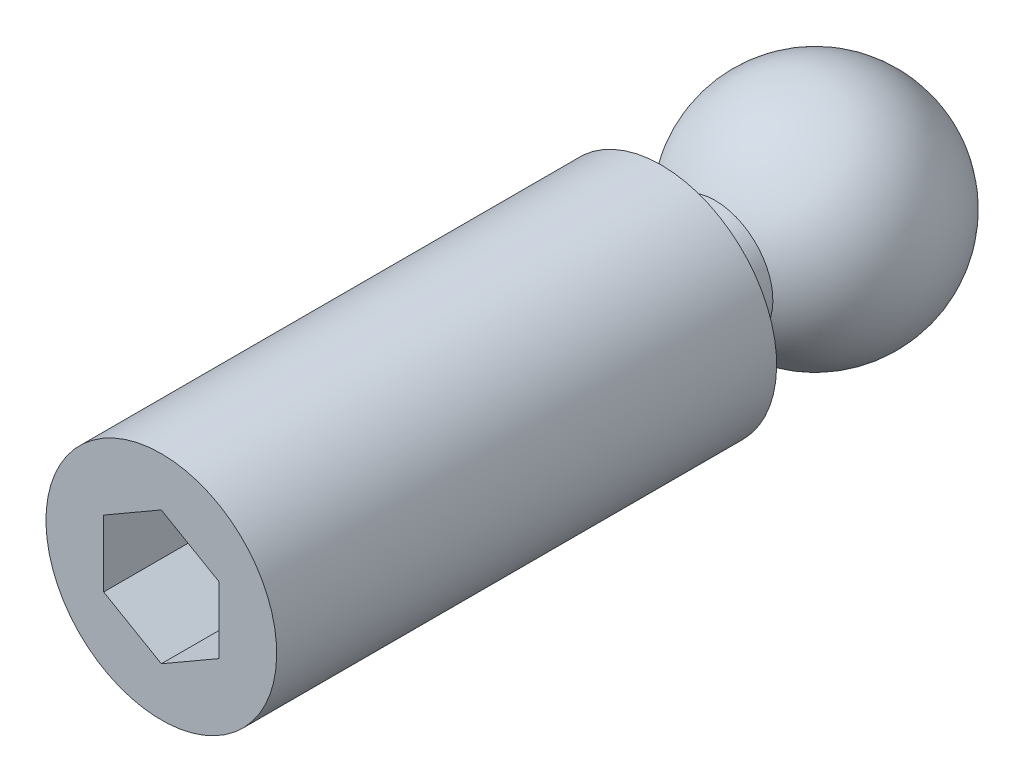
ISO-10303-21;
HEADER;
FILE_DESCRIPTION(('STEP AP214'),'2;1');
FILE_NAME('part.step','',(''),(''),'','','');
FILE_SCHEMA(('AUTOMOTIVE_DESIGN { 1 0 10303 214 1 1 1 1 }'));
ENDSEC;
DATA;
#1=APPLICATION_CONTEXT('core data for automotive mechanical design processes');
#2=APPLICATION_PROTOCOL_DEFINITION('international standard','automotive_design',2000,#1);
#3=PRODUCT_CONTEXT('',#1,'mechanical');
#4=PRODUCT('Part','Part','',(#3));
#5=PRODUCT_RELATED_PRODUCT_CATEGORY('part','',(#4));
#6=PRODUCT_DEFINITION_FORMATION('','',#4);
#7=PRODUCT_DEFINITION_CONTEXT('part definition',#1,'design');
#8=PRODUCT_DEFINITION('design','',#6,#7);
#9=PRODUCT_DEFINITION_SHAPE('','',#8);
#10=(LENGTH_UNIT() NAMED_UNIT(*) SI_UNIT(.MILLI.,.METRE.));
#11=(NAMED_UNIT(*) PLANE_ANGLE_UNIT() SI_UNIT($,.RADIAN.));
#12=(NAMED_UNIT(*) SI_UNIT($,.STERADIAN.) SOLID_ANGLE_UNIT());
#13=UNCERTAINTY_MEASURE_WITH_UNIT(LENGTH_MEASURE(1.E-05),#10,'distance_accuracy_value','');
#14=(GEOMETRIC_REPRESENTATION_CONTEXT(3) GLOBAL_UNCERTAINTY_ASSIGNED_CONTEXT((#13)) GLOBAL_UNIT_ASSIGNED_CONTEXT((#10,
#11,#12)) REPRESENTATION_CONTEXT('',''));
#15=CARTESIAN_POINT('',(0.,0.,0.));
#16=DIRECTION('',(0.,0.,1.));
#17=DIRECTION('',(1.,0.,0.));
#18=AXIS2_PLACEMENT_3D('',#15,#16,#17);
#19=CARTESIAN_POINT('',(0.,0.,3.));
#20=DIRECTION('',(0.,-1.,0.));
#21=DIRECTION('',(-1.,0.,0.));
#22=AXIS2_PLACEMENT_3D('',#19,#20,#21);
#23=SPHERICAL_SURFACE('',#22,3.);
#24=CARTESIAN_POINT('',(0.,0.,3.));
#25=DIRECTION('',(0.,0.,1.));
#26=DIRECTION('',(0.,1.,0.));
#27=AXIS2_PLACEMENT_3D('',#24,#25,#26);
#28=SPHERICAL_SURFACE('',#27,3.);
#29=CARTESIAN_POINT('',(0.,0.,5.59807621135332));
#30=DIRECTION('',(0.,0.,1.));
#31=DIRECTION('',(0.,1.,0.));
#32=AXIS2_PLACEMENT_3D('',#29,#30,#31);
#33=CIRCLE('',#32,1.5);
#34=CARTESIAN_POINT('',(0.,1.5,5.59807621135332));
#35=VERTEX_POINT('',#34);
#36=EDGE_CURVE('E9',#35,#35,#33,.T.);
#37=ORIENTED_EDGE('',*,*,#36,.F.);
#38=EDGE_LOOP('',(#37));
#39=FACE_BOUND('',#38,.T.);
#40=ADVANCED_FACE('F14',(#39),#28,.T.);
#41=CARTESIAN_POINT('',(0.,0.,30.));
#42=DIRECTION('',(0.,0.,1.));
#43=DIRECTION('',(0.,1.,0.));
#44=AXIS2_PLACEMENT_3D('',#41,#42,#43);
#45=CYLINDRICAL_SURFACE('',#44,1.5);
#46=ORIENTED_EDGE('',*,*,#36,.T.);
#47=EDGE_LOOP('',(#46));
#48=FACE_BOUND('',#47,.T.);
#49=CARTESIAN_POINT('',(0.,0.,7.));
#50=DIRECTION('',(0.,0.,1.));
#51=DIRECTION('',(0.,1.,0.));
#52=AXIS2_PLACEMENT_3D('',#49,#50,#51);
#53=CIRCLE('',#52,1.5);
#54=CARTESIAN_POINT('',(0.,1.5,7.));
#55=VERTEX_POINT('',#54);
#56=EDGE_CURVE('E21',#55,#55,#53,.T.);
#57=ORIENTED_EDGE('',*,*,#56,.F.);
#58=EDGE_LOOP('',(#57));
#59=FACE_BOUND('',#58,.T.);
#60=ADVANCED_FACE('F131',(#48,#59),#45,.T.);
#61=CARTESIAN_POINT('',(0.,-3.,7.));
#62=DIRECTION('',(0.,0.,-1.));
#63=DIRECTION('',(0.,-1.,0.));
#64=AXIS2_PLACEMENT_3D('',#61,#62,#63);
#65=PLANE('',#64);
#66=ORIENTED_EDGE('',*,*,#56,.T.);
#67=EDGE_LOOP('',(#66));
#68=FACE_BOUND('',#67,.T.);
#69=CARTESIAN_POINT('',(0.,0.,7.));
#70=DIRECTION('',(0.,0.,1.));
#71=DIRECTION('',(0.,1.,0.));
#72=AXIS2_PLACEMENT_3D('',#69,#70,#71);
#73=CIRCLE('',#72,3.);
#74=CARTESIAN_POINT('',(0.,3.,7.));
#75=VERTEX_POINT('',#74);
#76=EDGE_CURVE('E123',#75,#75,#73,.T.);
#77=ORIENTED_EDGE('',*,*,#76,.F.);
#78=EDGE_LOOP('',(#77));
#79=FACE_BOUND('',#78,.T.);
#80=ADVANCED_FACE('F128',(#68,#79),#65,.T.);
#81=CARTESIAN_POINT('',(0.,0.,30.));
#82=DIRECTION('',(0.,0.,1.));
#83=DIRECTION('',(0.,1.,0.));
#84=AXIS2_PLACEMENT_3D('',#81,#82,#83);
#85=CYLINDRICAL_SURFACE('',#84,3.);
#86=ORIENTED_EDGE('',*,*,#76,.T.);
#87=EDGE_LOOP('',(#86));
#88=FACE_BOUND('',#87,.T.);
#89=CARTESIAN_POINT('',(0.,0.,20.));
#90=DIRECTION('',(0.,0.,1.));
#91=DIRECTION('',(0.,1.,0.));
#92=AXIS2_PLACEMENT_3D('',#89,#90,#91);
#93=CIRCLE('',#92,3.);
#94=CARTESIAN_POINT('',(0.,3.,20.));
#95=VERTEX_POINT('',#94);
#96=EDGE_CURVE('E115',#95,#95,#93,.T.);
#97=ORIENTED_EDGE('',*,*,#96,.F.);
#98=EDGE_LOOP('',(#97));
#99=FACE_BOUND('',#98,.T.);
#100=ADVANCED_FACE('F139',(#88,#99),#85,.T.);
#101=CARTESIAN_POINT('',(0.,0.,20.));
#102=DIRECTION('',(0.,0.,1.));
#103=DIRECTION('',(0.,1.,0.));
#104=AXIS2_PLACEMENT_3D('',#101,#102,#103);
#105=PLANE('',#104);
#106=DIRECTION('',(-0.866025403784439,0.5,0.));
#107=VECTOR('',#106,1.);
#108=CARTESIAN_POINT('',(1.5,0.86602540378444,20.));
#109=LINE('',#108,#107);
#110=CARTESIAN_POINT('',(1.5,0.86602540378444,20.));
#111=VERTEX_POINT('',#110);
#112=CARTESIAN_POINT('',(0.,1.73205080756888,20.));
#113=VERTEX_POINT('',#112);
#114=EDGE_CURVE('E28',#111,#113,#109,.T.);
#115=ORIENTED_EDGE('',*,*,#114,.F.);
#116=DIRECTION('',(0.,1.,0.));
#117=VECTOR('',#116,1.);
#118=CARTESIAN_POINT('',(1.5,-0.866025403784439,20.));
#119=LINE('',#118,#117);
#120=CARTESIAN_POINT('',(1.5,-0.866025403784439,20.));
#121=VERTEX_POINT('',#120);
#122=EDGE_CURVE('E111',#121,#111,#119,.T.);
#123=ORIENTED_EDGE('',*,*,#122,.F.);
#124=DIRECTION('',(0.866025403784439,0.5,0.));
#125=VECTOR('',#124,1.);
#126=CARTESIAN_POINT('',(0.,-1.73205080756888,20.));
#127=LINE('',#126,#125);
#128=CARTESIAN_POINT('',(0.,-1.73205080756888,20.));
#129=VERTEX_POINT('',#128);
#130=EDGE_CURVE('E109',#129,#121,#127,.T.);
#131=ORIENTED_EDGE('',*,*,#130,.F.);
#132=DIRECTION('',(0.866025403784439,-0.5,0.));
#133=VECTOR('',#132,1.);
#134=CARTESIAN_POINT('',(-1.5,-0.866025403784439,20.));
#135=LINE('',#134,#133);
#136=CARTESIAN_POINT('',(-1.5,-0.866025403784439,20.));
#137=VERTEX_POINT('',#136);
#138=EDGE_CURVE('E76',#137,#129,#135,.T.);
#139=ORIENTED_EDGE('',*,*,#138,.F.);
#140=DIRECTION('',(0.,-1.,0.));
#141=VECTOR('',#140,1.);
#142=CARTESIAN_POINT('',(-1.5,0.866025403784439,20.));
#143=LINE('',#142,#141);
#144=CARTESIAN_POINT('',(-1.5,0.866025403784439,20.));
#145=VERTEX_POINT('',#144);
#146=EDGE_CURVE('E105',#145,#137,#143,.T.);
#147=ORIENTED_EDGE('',*,*,#146,.F.);
#148=DIRECTION('',(-0.866025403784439,-0.5,0.));
#149=VECTOR('',#148,1.);
#150=CARTESIAN_POINT('',(0.,1.73205080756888,20.));
#151=LINE('',#150,#149);
#152=EDGE_CURVE('E102',#113,#145,#151,.T.);
#153=ORIENTED_EDGE('',*,*,#152,.F.);
#154=EDGE_LOOP('',(#115,#123,#131,#139,#147,#153));
#155=FACE_BOUND('',#154,.T.);
#156=ORIENTED_EDGE('',*,*,#96,.T.);
#157=EDGE_LOOP('',(#156));
#158=FACE_BOUND('',#157,.T.);
#159=ADVANCED_FACE('F145',(#155,#158),#105,.T.);
#160=CARTESIAN_POINT('',(1.5,0.86602540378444,16.));
#161=DIRECTION('',(0.5,0.866025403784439,0.));
#162=DIRECTION('',(-0.866025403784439,0.5,0.));
#163=AXIS2_PLACEMENT_3D('',#160,#161,#162);
#164=PLANE('',#163);
#165=ORIENTED_EDGE('',*,*,#114,.T.);
#166=DIRECTION('',(0.,0.,1.));
#167=VECTOR('',#166,1.);
#168=CARTESIAN_POINT('',(0.,1.73205080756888,16.));
#169=LINE('',#168,#167);
#170=CARTESIAN_POINT('',(0.,1.73205080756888,16.));
#171=VERTEX_POINT('',#170);
#172=EDGE_CURVE('E58',#171,#113,#169,.T.);
#173=ORIENTED_EDGE('',*,*,#172,.F.);
#174=DIRECTION('',(-0.866025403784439,0.5,0.));
#175=VECTOR('',#174,1.);
#176=CARTESIAN_POINT('',(1.5,0.86602540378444,16.));
#177=LINE('',#176,#175);
#178=CARTESIAN_POINT('',(1.5,0.86602540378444,16.));
#179=VERTEX_POINT('',#178);
#180=EDGE_CURVE('E113',#179,#171,#177,.T.);
#181=ORIENTED_EDGE('',*,*,#180,.F.);
#182=DIRECTION('',(0.,0.,1.));
#183=VECTOR('',#182,1.);
#184=CARTESIAN_POINT('',(1.5,0.86602540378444,16.));
#185=LINE('',#184,#183);
#186=EDGE_CURVE('E36',#179,#111,#185,.T.);
#187=ORIENTED_EDGE('',*,*,#186,.T.);
#188=EDGE_LOOP('',(#165,#173,#181,#187));
#189=FACE_BOUND('',#188,.T.);
#190=ADVANCED_FACE('F149',(#189),#164,.F.);
#191=CARTESIAN_POINT('',(1.5,-0.866025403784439,16.));
#192=DIRECTION('',(1.,0.,0.));
#193=DIRECTION('',(0.,0.,-1.));
#194=AXIS2_PLACEMENT_3D('',#191,#192,#193);
#195=PLANE('',#194);
#196=ORIENTED_EDGE('',*,*,#122,.T.);
#197=ORIENTED_EDGE('',*,*,#186,.F.);
#198=DIRECTION('',(0.,1.,0.));
#199=VECTOR('',#198,1.);
#200=CARTESIAN_POINT('',(1.5,-0.866025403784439,16.));
#201=LINE('',#200,#199);
#202=CARTESIAN_POINT('',(1.5,-0.866025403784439,16.));
#203=VERTEX_POINT('',#202);
#204=EDGE_CURVE('E88',#203,#179,#201,.T.);
#205=ORIENTED_EDGE('',*,*,#204,.F.);
#206=DIRECTION('',(0.,0.,1.));
#207=VECTOR('',#206,1.);
#208=CARTESIAN_POINT('',(1.5,-0.866025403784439,16.));
#209=LINE('',#208,#207);
#210=EDGE_CURVE('E80',#203,#121,#209,.T.);
#211=ORIENTED_EDGE('',*,*,#210,.T.);
#212=EDGE_LOOP('',(#196,#197,#205,#211));
#213=FACE_BOUND('',#212,.T.);
#214=ADVANCED_FACE('F153',(#213),#195,.F.);
#215=CARTESIAN_POINT('',(0.,-1.73205080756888,16.));
#216=DIRECTION('',(0.5,-0.866025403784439,0.));
#217=DIRECTION('',(0.866025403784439,0.5,0.));
#218=AXIS2_PLACEMENT_3D('',#215,#216,#217);
#219=PLANE('',#218);
#220=ORIENTED_EDGE('',*,*,#130,.T.);
#221=ORIENTED_EDGE('',*,*,#210,.F.);
#222=DIRECTION('',(0.866025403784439,0.5,0.));
#223=VECTOR('',#222,1.);
#224=CARTESIAN_POINT('',(0.,-1.73205080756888,16.));
#225=LINE('',#224,#223);
#226=CARTESIAN_POINT('',(0.,-1.73205080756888,16.));
#227=VERTEX_POINT('',#226);
#228=EDGE_CURVE('E84',#227,#203,#225,.T.);
#229=ORIENTED_EDGE('',*,*,#228,.F.);
#230=DIRECTION('',(0.,0.,1.));
#231=VECTOR('',#230,1.);
#232=CARTESIAN_POINT('',(0.,-1.73205080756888,16.));
#233=LINE('',#232,#231);
#234=EDGE_CURVE('E69',#227,#129,#233,.T.);
#235=ORIENTED_EDGE('',*,*,#234,.T.);
#236=EDGE_LOOP('',(#220,#221,#229,#235));
#237=FACE_BOUND('',#236,.T.);
#238=ADVANCED_FACE('F85',(#237),#219,.F.);
#239=CARTESIAN_POINT('',(-1.5,-0.866025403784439,16.));
#240=DIRECTION('',(-0.5,-0.866025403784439,0.));
#241=DIRECTION('',(0.866025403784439,-0.5,0.));
#242=AXIS2_PLACEMENT_3D('',#239,#240,#241);
#243=PLANE('',#242);
#244=ORIENTED_EDGE('',*,*,#138,.T.);
#245=ORIENTED_EDGE('',*,*,#234,.F.);
#246=DIRECTION('',(0.866025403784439,-0.5,0.));
#247=VECTOR('',#246,1.);
#248=CARTESIAN_POINT('',(-1.5,-0.866025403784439,16.));
#249=LINE('',#248,#247);
#250=CARTESIAN_POINT('',(-1.5,-0.866025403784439,16.));
#251=VERTEX_POINT('',#250);
#252=EDGE_CURVE('E73',#251,#227,#249,.T.);
#253=ORIENTED_EDGE('',*,*,#252,.F.);
#254=DIRECTION('',(0.,0.,1.));
#255=VECTOR('',#254,1.);
#256=CARTESIAN_POINT('',(-1.5,-0.866025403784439,16.));
#257=LINE('',#256,#255);
#258=EDGE_CURVE('E81',#251,#137,#257,.T.);
#259=ORIENTED_EDGE('',*,*,#258,.T.);
#260=EDGE_LOOP('',(#244,#245,#253,#259));
#261=FACE_BOUND('',#260,.T.);
#262=ADVANCED_FACE('F71',(#261),#243,.F.);
#263=CARTESIAN_POINT('',(-1.5,0.866025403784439,16.));
#264=DIRECTION('',(-1.,0.,0.));
#265=DIRECTION('',(0.,0.,1.));
#266=AXIS2_PLACEMENT_3D('',#263,#264,#265);
#267=PLANE('',#266);
#268=ORIENTED_EDGE('',*,*,#146,.T.);
#269=ORIENTED_EDGE('',*,*,#258,.F.);
#270=DIRECTION('',(0.,-1.,0.));
#271=VECTOR('',#270,1.);
#272=CARTESIAN_POINT('',(-1.5,0.866025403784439,16.));
#273=LINE('',#272,#271);
#274=CARTESIAN_POINT('',(-1.5,0.866025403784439,16.));
#275=VERTEX_POINT('',#274);
#276=EDGE_CURVE('E94',#275,#251,#273,.T.);
#277=ORIENTED_EDGE('',*,*,#276,.F.);
#278=DIRECTION('',(0.,0.,1.));
#279=VECTOR('',#278,1.);
#280=CARTESIAN_POINT('',(-1.5,0.866025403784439,16.));
#281=LINE('',#280,#279);
#282=EDGE_CURVE('E118',#275,#145,#281,.T.);
#283=ORIENTED_EDGE('',*,*,#282,.T.);
#284=EDGE_LOOP('',(#268,#269,#277,#283));
#285=FACE_BOUND('',#284,.T.);
#286=ADVANCED_FACE('F157',(#285),#267,.F.);
#287=CARTESIAN_POINT('',(0.,1.73205080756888,16.));
#288=DIRECTION('',(-0.5,0.866025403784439,0.));
#289=DIRECTION('',(-0.866025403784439,-0.5,0.));
#290=AXIS2_PLACEMENT_3D('',#287,#288,#289);
#291=PLANE('',#290);
#292=ORIENTED_EDGE('',*,*,#152,.T.);
#293=ORIENTED_EDGE('',*,*,#282,.F.);
#294=DIRECTION('',(-0.866025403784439,-0.5,0.));
#295=VECTOR('',#294,1.);
#296=CARTESIAN_POINT('',(0.,1.73205080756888,16.));
#297=LINE('',#296,#295);
#298=EDGE_CURVE('E96',#171,#275,#297,.T.);
#299=ORIENTED_EDGE('',*,*,#298,.F.);
#300=ORIENTED_EDGE('',*,*,#172,.T.);
#301=EDGE_LOOP('',(#292,#293,#299,#300));
#302=FACE_BOUND('',#301,.T.);
#303=ADVANCED_FACE('F154',(#302),#291,.F.);
#304=CARTESIAN_POINT('',(0.,1.73205080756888,16.));
#305=DIRECTION('',(0.,0.,1.));
#306=DIRECTION('',(1.,0.,0.));
#307=AXIS2_PLACEMENT_3D('',#304,#305,#306);
#308=PLANE('',#307);
#309=ORIENTED_EDGE('',*,*,#180,.T.);
#310=ORIENTED_EDGE('',*,*,#298,.T.);
#311=ORIENTED_EDGE('',*,*,#276,.T.);
#312=ORIENTED_EDGE('',*,*,#252,.T.);
#313=ORIENTED_EDGE('',*,*,#228,.T.);
#314=ORIENTED_EDGE('',*,*,#204,.T.);
#315=EDGE_LOOP('',(#309,#310,#311,#312,#313,#314));
#316=FACE_BOUND('',#315,.T.);
#317=ADVANCED_FACE('F91',(#316),#308,.T.);
#318=CLOSED_SHELL('',(#40,#60,#80,#100,#159,#190,#214,#238,#262,#286,#303,#317));
#319=MANIFOLD_SOLID_BREP('B1',#318);
#320=ADVANCED_BREP_SHAPE_REPRESENTATION('',(#18,#319),#14);
#321=SHAPE_DEFINITION_REPRESENTATION(#9,#320);
ENDSEC;
END-ISO-10303-21;
